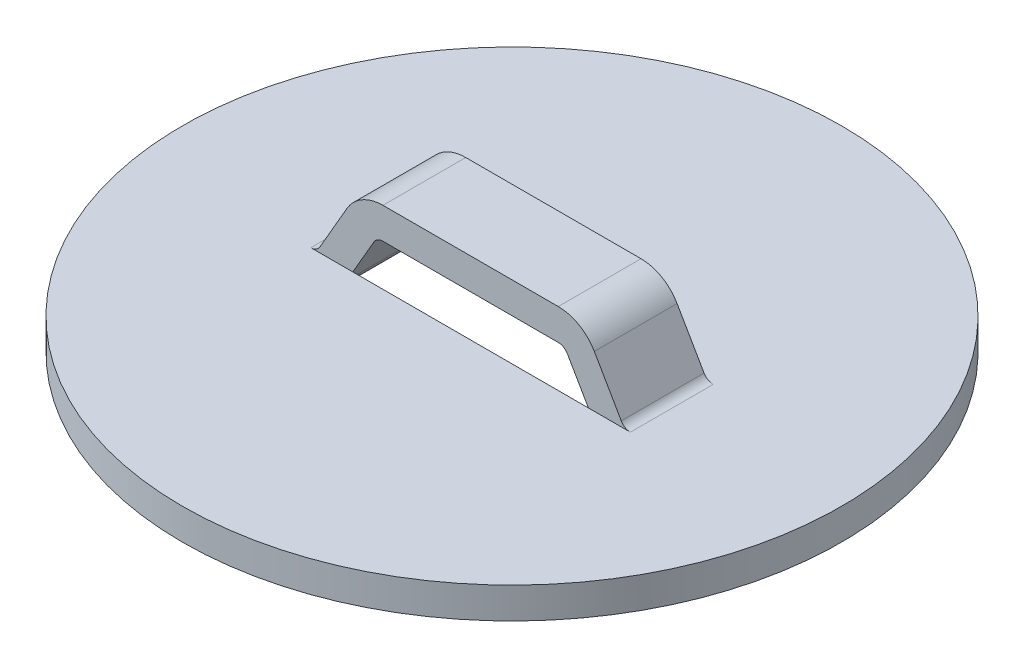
ISO-10303-21;
HEADER;
FILE_DESCRIPTION(('STEP AP214'),'2;1');
FILE_NAME('part.step','',(''),(''),'','','');
FILE_SCHEMA(('AUTOMOTIVE_DESIGN { 1 0 10303 214 1 1 1 1 }'));
ENDSEC;
DATA;
#1=APPLICATION_CONTEXT('core data for automotive mechanical design processes');
#2=APPLICATION_PROTOCOL_DEFINITION('international standard','automotive_design',2000,#1);
#3=PRODUCT_CONTEXT('',#1,'mechanical');
#4=PRODUCT('Part','Part','',(#3));
#5=PRODUCT_RELATED_PRODUCT_CATEGORY('part','',(#4));
#6=PRODUCT_DEFINITION_FORMATION('','',#4);
#7=PRODUCT_DEFINITION_CONTEXT('part definition',#1,'design');
#8=PRODUCT_DEFINITION('design','',#6,#7);
#9=PRODUCT_DEFINITION_SHAPE('','',#8);
#10=(LENGTH_UNIT() NAMED_UNIT(*) SI_UNIT(.MILLI.,.METRE.));
#11=(NAMED_UNIT(*) PLANE_ANGLE_UNIT() SI_UNIT($,.RADIAN.));
#12=(NAMED_UNIT(*) SI_UNIT($,.STERADIAN.) SOLID_ANGLE_UNIT());
#13=UNCERTAINTY_MEASURE_WITH_UNIT(LENGTH_MEASURE(1.E-05),#10,'distance_accuracy_value','');
#14=(GEOMETRIC_REPRESENTATION_CONTEXT(3) GLOBAL_UNCERTAINTY_ASSIGNED_CONTEXT((#13)) GLOBAL_UNIT_ASSIGNED_CONTEXT((#10,
#11,#12)) REPRESENTATION_CONTEXT('',''));
#15=CARTESIAN_POINT('',(0.,0.,0.));
#16=DIRECTION('',(0.,0.,1.));
#17=DIRECTION('',(1.,0.,0.));
#18=AXIS2_PLACEMENT_3D('',#15,#16,#17);
#19=CARTESIAN_POINT('',(-7.69739393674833,0.508,0.));
#20=DIRECTION('',(0.,0.,-1.));
#21=DIRECTION('',(-1.,0.,0.));
#22=AXIS2_PLACEMENT_3D('',#19,#20,#21);
#23=PLANE('',#22);
#24=DIRECTION('',(-1.,0.,0.));
#25=VECTOR('',#24,1.);
#26=CARTESIAN_POINT('',(-7.69739393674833,0.,0.));
#27=LINE('',#26,#25);
#28=CARTESIAN_POINT('',(7.69739393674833,0.,0.));
#29=VERTEX_POINT('',#28);
#30=CARTESIAN_POINT('',(5.67366577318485,0.,0.));
#31=VERTEX_POINT('',#30);
#32=EDGE_CURVE('E53',#29,#31,#27,.T.);
#33=ORIENTED_EDGE('',*,*,#32,.F.);
#34=CARTESIAN_POINT('',(7.69739393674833,0.508,0.));
#35=DIRECTION('',(0.,0.,1.));
#36=DIRECTION('',(1.,0.,0.));
#37=AXIS2_PLACEMENT_3D('',#34,#35,#36);
#38=CIRCLE('',#37,0.508);
#39=CARTESIAN_POINT('',(7.25745303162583,0.254000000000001,0.));
#40=VERTEX_POINT('',#39);
#41=EDGE_CURVE('E165',#29,#40,#38,.F.);
#42=ORIENTED_EDGE('',*,*,#41,.T.);
#43=DIRECTION('',(-0.499999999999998,0.86602540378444,0.));
#44=VECTOR('',#43,1.);
#45=CARTESIAN_POINT('',(5.95962736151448,2.5019,0.));
#46=LINE('',#45,#44);
#47=CARTESIAN_POINT('',(5.95962736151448,2.5019,0.));
#48=VERTEX_POINT('',#47);
#49=EDGE_CURVE('E196',#48,#40,#46,.F.);
#50=ORIENTED_EDGE('',*,*,#49,.F.);
#51=CARTESIAN_POINT('',(4.22186078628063,1.4986,0.));
#52=DIRECTION('',(0.,0.,1.));
#53=DIRECTION('',(1.,0.,0.));
#54=AXIS2_PLACEMENT_3D('',#51,#52,#53);
#55=CIRCLE('',#54,2.0066);
#56=CARTESIAN_POINT('',(4.22186078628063,3.5052,0.));
#57=VERTEX_POINT('',#56);
#58=EDGE_CURVE('E200',#57,#48,#55,.F.);
#59=ORIENTED_EDGE('',*,*,#58,.F.);
#60=DIRECTION('',(1.,0.,0.));
#61=VECTOR('',#60,1.);
#62=CARTESIAN_POINT('',(-4.22186078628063,3.5052,0.));
#63=LINE('',#62,#61);
#64=CARTESIAN_POINT('',(-4.22186078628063,3.5052,0.));
#65=VERTEX_POINT('',#64);
#66=EDGE_CURVE('E204',#65,#57,#63,.T.);
#67=ORIENTED_EDGE('',*,*,#66,.F.);
#68=CARTESIAN_POINT('',(-4.22186078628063,1.4986,0.));
#69=DIRECTION('',(0.,0.,1.));
#70=DIRECTION('',(1.,0.,0.));
#71=AXIS2_PLACEMENT_3D('',#68,#69,#70);
#72=CIRCLE('',#71,2.0066);
#73=CARTESIAN_POINT('',(-5.95962736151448,2.5019,0.));
#74=VERTEX_POINT('',#73);
#75=EDGE_CURVE('E208',#74,#65,#72,.F.);
#76=ORIENTED_EDGE('',*,*,#75,.F.);
#77=DIRECTION('',(-0.499999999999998,-0.86602540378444,0.));
#78=VECTOR('',#77,1.);
#79=CARTESIAN_POINT('',(-7.25745303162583,0.254000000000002,0.));
#80=LINE('',#79,#78);
#81=CARTESIAN_POINT('',(-7.25745303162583,0.254000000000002,0.));
#82=VERTEX_POINT('',#81);
#83=EDGE_CURVE('E212',#82,#74,#80,.F.);
#84=ORIENTED_EDGE('',*,*,#83,.F.);
#85=CARTESIAN_POINT('',(-7.69739393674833,0.508,0.));
#86=DIRECTION('',(0.,0.,1.));
#87=DIRECTION('',(1.,0.,0.));
#88=AXIS2_PLACEMENT_3D('',#85,#86,#87);
#89=CIRCLE('',#88,0.507999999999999);
#90=CARTESIAN_POINT('',(-7.69739393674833,0.,0.));
#91=VERTEX_POINT('',#90);
#92=EDGE_CURVE('E216',#82,#91,#89,.F.);
#93=ORIENTED_EDGE('',*,*,#92,.T.);
#94=CARTESIAN_POINT('',(-5.67366577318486,0.,0.));
#95=VERTEX_POINT('',#94);
#96=EDGE_CURVE('E173',#95,#91,#27,.T.);
#97=ORIENTED_EDGE('',*,*,#96,.F.);
#98=DIRECTION('',(0.499999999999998,0.86602540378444,0.));
#99=VECTOR('',#98,1.);
#100=CARTESIAN_POINT('',(-5.95962736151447,-0.495299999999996,0.));
#101=LINE('',#100,#99);
#102=CARTESIAN_POINT('',(-4.66180169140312,1.7526,0.));
#103=VERTEX_POINT('',#102);
#104=EDGE_CURVE('E218',#103,#95,#101,.F.);
#105=ORIENTED_EDGE('',*,*,#104,.F.);
#106=CARTESIAN_POINT('',(-4.22186078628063,1.4986,0.));
#107=DIRECTION('',(0.,0.,1.));
#108=DIRECTION('',(1.,0.,0.));
#109=AXIS2_PLACEMENT_3D('',#106,#107,#108);
#110=CIRCLE('',#109,0.508);
#111=CARTESIAN_POINT('',(-4.22186078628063,2.0066,0.));
#112=VERTEX_POINT('',#111);
#113=EDGE_CURVE('E222',#103,#112,#110,.F.);
#114=ORIENTED_EDGE('',*,*,#113,.T.);
#115=DIRECTION('',(1.,0.,0.));
#116=VECTOR('',#115,1.);
#117=CARTESIAN_POINT('',(-4.22186078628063,2.0066,0.));
#118=LINE('',#117,#116);
#119=CARTESIAN_POINT('',(4.22186078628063,2.0066,0.));
#120=VERTEX_POINT('',#119);
#121=EDGE_CURVE('E223',#120,#112,#118,.F.);
#122=ORIENTED_EDGE('',*,*,#121,.F.);
#123=CARTESIAN_POINT('',(4.22186078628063,1.4986,0.));
#124=DIRECTION('',(0.,0.,1.));
#125=DIRECTION('',(1.,0.,0.));
#126=AXIS2_PLACEMENT_3D('',#123,#124,#125);
#127=CIRCLE('',#126,0.508);
#128=CARTESIAN_POINT('',(4.66180169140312,1.7526,0.));
#129=VERTEX_POINT('',#128);
#130=EDGE_CURVE('E226',#120,#129,#127,.F.);
#131=ORIENTED_EDGE('',*,*,#130,.T.);
#132=DIRECTION('',(0.499999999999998,-0.86602540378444,0.));
#133=VECTOR('',#132,1.);
#134=CARTESIAN_POINT('',(4.66180169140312,1.7526,0.));
#135=LINE('',#134,#133);
#136=EDGE_CURVE('E168',#31,#129,#135,.F.);
#137=ORIENTED_EDGE('',*,*,#136,.F.);
#138=EDGE_LOOP('',(#33,#42,#50,#59,#67,#76,#84,#93,#97,#105,#114,#122,#131,#137));
#139=FACE_BOUND('',#138,.T.);
#140=ADVANCED_FACE('F39',(#139),#23,.F.);
#141=CARTESIAN_POINT('',(-7.69739393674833,0.508,-3.9878));
#142=DIRECTION('',(0.,0.,-1.));
#143=DIRECTION('',(-1.,0.,0.));
#144=AXIS2_PLACEMENT_3D('',#141,#142,#143);
#145=PLANE('',#144);
#146=CARTESIAN_POINT('',(7.69739393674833,0.508,-3.9878));
#147=DIRECTION('',(0.,0.,1.));
#148=DIRECTION('',(1.,0.,0.));
#149=AXIS2_PLACEMENT_3D('',#146,#147,#148);
#150=CIRCLE('',#149,0.508);
#151=CARTESIAN_POINT('',(7.25745303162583,0.254000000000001,-3.9878));
#152=VERTEX_POINT('',#151);
#153=CARTESIAN_POINT('',(7.69739393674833,0.,-3.9878));
#154=VERTEX_POINT('',#153);
#155=EDGE_CURVE('E250',#152,#154,#150,.T.);
#156=ORIENTED_EDGE('',*,*,#155,.T.);
#157=DIRECTION('',(-1.,0.,0.));
#158=VECTOR('',#157,1.);
#159=CARTESIAN_POINT('',(-7.69739393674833,0.,-3.9878));
#160=LINE('',#159,#158);
#161=CARTESIAN_POINT('',(5.67366577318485,0.,-3.9878));
#162=VERTEX_POINT('',#161);
#163=EDGE_CURVE('E11',#154,#162,#160,.T.);
#164=ORIENTED_EDGE('',*,*,#163,.T.);
#165=DIRECTION('',(-0.499999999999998,0.86602540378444,0.));
#166=VECTOR('',#165,1.);
#167=CARTESIAN_POINT('',(5.95962736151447,-0.495299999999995,-3.9878));
#168=LINE('',#167,#166);
#169=CARTESIAN_POINT('',(4.66180169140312,1.7526,-3.9878));
#170=VERTEX_POINT('',#169);
#171=EDGE_CURVE('E249',#162,#170,#168,.T.);
#172=ORIENTED_EDGE('',*,*,#171,.T.);
#173=CARTESIAN_POINT('',(4.22186078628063,1.4986,-3.9878));
#174=DIRECTION('',(0.,0.,1.));
#175=DIRECTION('',(1.,0.,0.));
#176=AXIS2_PLACEMENT_3D('',#173,#174,#175);
#177=CIRCLE('',#176,0.508);
#178=CARTESIAN_POINT('',(4.22186078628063,2.0066,-3.9878));
#179=VERTEX_POINT('',#178);
#180=EDGE_CURVE('E242',#170,#179,#177,.T.);
#181=ORIENTED_EDGE('',*,*,#180,.T.);
#182=DIRECTION('',(-1.,0.,0.));
#183=VECTOR('',#182,1.);
#184=CARTESIAN_POINT('',(-7.69739393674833,2.0066,-3.9878));
#185=LINE('',#184,#183);
#186=CARTESIAN_POINT('',(-4.22186078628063,2.0066,-3.9878));
#187=VERTEX_POINT('',#186);
#188=EDGE_CURVE('E241',#179,#187,#185,.T.);
#189=ORIENTED_EDGE('',*,*,#188,.T.);
#190=CARTESIAN_POINT('',(-4.22186078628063,1.4986,-3.9878));
#191=DIRECTION('',(0.,0.,1.));
#192=DIRECTION('',(1.,0.,0.));
#193=AXIS2_PLACEMENT_3D('',#190,#191,#192);
#194=CIRCLE('',#193,0.508);
#195=CARTESIAN_POINT('',(-4.66180169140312,1.7526,-3.9878));
#196=VERTEX_POINT('',#195);
#197=EDGE_CURVE('E238',#187,#196,#194,.T.);
#198=ORIENTED_EDGE('',*,*,#197,.T.);
#199=DIRECTION('',(-0.499999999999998,-0.86602540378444,0.));
#200=VECTOR('',#199,1.);
#201=CARTESIAN_POINT('',(-4.66180169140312,1.7526,-3.9878));
#202=LINE('',#201,#200);
#203=CARTESIAN_POINT('',(-5.67366577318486,0.,-3.9878));
#204=VERTEX_POINT('',#203);
#205=EDGE_CURVE('E237',#196,#204,#202,.T.);
#206=ORIENTED_EDGE('',*,*,#205,.T.);
#207=DIRECTION('',(1.,0.,0.));
#208=VECTOR('',#207,1.);
#209=CARTESIAN_POINT('',(-7.69739393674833,0.,-3.9878));
#210=LINE('',#209,#208);
#211=CARTESIAN_POINT('',(-7.69739393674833,0.,-3.9878));
#212=VERTEX_POINT('',#211);
#213=EDGE_CURVE('E285',#212,#204,#210,.T.);
#214=ORIENTED_EDGE('',*,*,#213,.F.);
#215=CARTESIAN_POINT('',(-7.69739393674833,0.508,-3.9878));
#216=DIRECTION('',(0.,0.,1.));
#217=DIRECTION('',(1.,0.,0.));
#218=AXIS2_PLACEMENT_3D('',#215,#216,#217);
#219=CIRCLE('',#218,0.507999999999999);
#220=CARTESIAN_POINT('',(-7.25745303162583,0.254000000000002,-3.9878));
#221=VERTEX_POINT('',#220);
#222=EDGE_CURVE('E261',#212,#221,#219,.T.);
#223=ORIENTED_EDGE('',*,*,#222,.T.);
#224=DIRECTION('',(0.499999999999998,0.86602540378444,0.));
#225=VECTOR('',#224,1.);
#226=CARTESIAN_POINT('',(-7.25745303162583,0.254000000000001,-3.9878));
#227=LINE('',#226,#225);
#228=CARTESIAN_POINT('',(-5.95962736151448,2.5019,-3.9878));
#229=VERTEX_POINT('',#228);
#230=EDGE_CURVE('E260',#221,#229,#227,.T.);
#231=ORIENTED_EDGE('',*,*,#230,.T.);
#232=CARTESIAN_POINT('',(-4.22186078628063,1.4986,-3.9878));
#233=DIRECTION('',(0.,0.,1.));
#234=DIRECTION('',(1.,0.,0.));
#235=AXIS2_PLACEMENT_3D('',#232,#233,#234);
#236=CIRCLE('',#235,2.0066);
#237=CARTESIAN_POINT('',(-4.22186078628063,3.5052,-3.9878));
#238=VERTEX_POINT('',#237);
#239=EDGE_CURVE('E257',#229,#238,#236,.F.);
#240=ORIENTED_EDGE('',*,*,#239,.T.);
#241=DIRECTION('',(-1.,0.,0.));
#242=VECTOR('',#241,1.);
#243=CARTESIAN_POINT('',(-7.69739393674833,3.5052,-3.9878));
#244=LINE('',#243,#242);
#245=CARTESIAN_POINT('',(4.22186078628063,3.5052,-3.9878));
#246=VERTEX_POINT('',#245);
#247=EDGE_CURVE('E256',#238,#246,#244,.F.);
#248=ORIENTED_EDGE('',*,*,#247,.T.);
#249=CARTESIAN_POINT('',(4.22186078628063,1.4986,-3.9878));
#250=DIRECTION('',(0.,0.,1.));
#251=DIRECTION('',(1.,0.,0.));
#252=AXIS2_PLACEMENT_3D('',#249,#250,#251);
#253=CIRCLE('',#252,2.0066);
#254=CARTESIAN_POINT('',(5.95962736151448,2.5019,-3.9878));
#255=VERTEX_POINT('',#254);
#256=EDGE_CURVE('E253',#246,#255,#253,.F.);
#257=ORIENTED_EDGE('',*,*,#256,.T.);
#258=DIRECTION('',(0.499999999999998,-0.86602540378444,0.));
#259=VECTOR('',#258,1.);
#260=CARTESIAN_POINT('',(5.95962736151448,2.5019,-3.9878));
#261=LINE('',#260,#259);
#262=EDGE_CURVE('E252',#255,#152,#261,.T.);
#263=ORIENTED_EDGE('',*,*,#262,.T.);
#264=EDGE_LOOP('',(#156,#164,#172,#181,#189,#198,#206,#214,#223,#231,#240,#248,#257,#263));
#265=FACE_BOUND('',#264,.T.);
#266=ADVANCED_FACE('F355',(#265),#145,.T.);
#267=CARTESIAN_POINT('',(-7.69739393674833,0.508,-3.9878));
#268=DIRECTION('',(0.,0.,1.));
#269=DIRECTION('',(1.,0.,0.));
#270=AXIS2_PLACEMENT_3D('',#267,#268,#269);
#271=CYLINDRICAL_SURFACE('',#270,0.507999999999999);
#272=DIRECTION('',(0.,0.,1.));
#273=VECTOR('',#272,1.);
#274=CARTESIAN_POINT('',(-7.25745303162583,0.254000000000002,-3.9878));
#275=LINE('',#274,#273);
#276=EDGE_CURVE('E209',#221,#82,#275,.T.);
#277=ORIENTED_EDGE('',*,*,#276,.F.);
#278=ORIENTED_EDGE('',*,*,#222,.F.);
#279=DIRECTION('',(0.,0.,1.));
#280=VECTOR('',#279,1.);
#281=CARTESIAN_POINT('',(-7.69739393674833,0.,-3.9878));
#282=LINE('',#281,#280);
#283=EDGE_CURVE('E213',#91,#212,#282,.F.);
#284=ORIENTED_EDGE('',*,*,#283,.F.);
#285=ORIENTED_EDGE('',*,*,#92,.F.);
#286=EDGE_LOOP('',(#277,#278,#284,#285));
#287=FACE_BOUND('',#286,.T.);
#288=ADVANCED_FACE('F283',(#287),#271,.F.);
#289=CARTESIAN_POINT('',(-7.25745303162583,0.254000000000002,-3.9878));
#290=DIRECTION('',(-0.86602540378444,0.499999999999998,0.));
#291=DIRECTION('',(-0.499999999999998,-0.86602540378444,0.));
#292=AXIS2_PLACEMENT_3D('',#289,#290,#291);
#293=PLANE('',#292);
#294=ORIENTED_EDGE('',*,*,#230,.F.);
#295=ORIENTED_EDGE('',*,*,#276,.T.);
#296=ORIENTED_EDGE('',*,*,#83,.T.);
#297=DIRECTION('',(0.,0.,1.));
#298=VECTOR('',#297,1.);
#299=CARTESIAN_POINT('',(-5.95962736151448,2.5019,-3.9878));
#300=LINE('',#299,#298);
#301=EDGE_CURVE('E205',#229,#74,#300,.T.);
#302=ORIENTED_EDGE('',*,*,#301,.F.);
#303=EDGE_LOOP('',(#294,#295,#296,#302));
#304=FACE_BOUND('',#303,.T.);
#305=ADVANCED_FACE('F364',(#304),#293,.T.);
#306=CARTESIAN_POINT('',(-4.22186078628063,1.4986,-3.9878));
#307=DIRECTION('',(0.,0.,1.));
#308=DIRECTION('',(1.,0.,0.));
#309=AXIS2_PLACEMENT_3D('',#306,#307,#308);
#310=CYLINDRICAL_SURFACE('',#309,2.0066);
#311=ORIENTED_EDGE('',*,*,#239,.F.);
#312=ORIENTED_EDGE('',*,*,#301,.T.);
#313=ORIENTED_EDGE('',*,*,#75,.T.);
#314=DIRECTION('',(0.,0.,1.));
#315=VECTOR('',#314,1.);
#316=CARTESIAN_POINT('',(-4.22186078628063,3.5052,-3.9878));
#317=LINE('',#316,#315);
#318=EDGE_CURVE('E201',#238,#65,#317,.T.);
#319=ORIENTED_EDGE('',*,*,#318,.F.);
#320=EDGE_LOOP('',(#311,#312,#313,#319));
#321=FACE_BOUND('',#320,.T.);
#322=ADVANCED_FACE('F407',(#321),#310,.T.);
#323=CARTESIAN_POINT('',(-4.22186078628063,3.5052,-3.9878));
#324=DIRECTION('',(0.,1.,0.));
#325=DIRECTION('',(0.,0.,1.));
#326=AXIS2_PLACEMENT_3D('',#323,#324,#325);
#327=PLANE('',#326);
#328=ORIENTED_EDGE('',*,*,#247,.F.);
#329=ORIENTED_EDGE('',*,*,#318,.T.);
#330=ORIENTED_EDGE('',*,*,#66,.T.);
#331=DIRECTION('',(0.,0.,1.));
#332=VECTOR('',#331,1.);
#333=CARTESIAN_POINT('',(4.22186078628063,3.5052,-3.9878));
#334=LINE('',#333,#332);
#335=EDGE_CURVE('E197',#246,#57,#334,.T.);
#336=ORIENTED_EDGE('',*,*,#335,.F.);
#337=EDGE_LOOP('',(#328,#329,#330,#336));
#338=FACE_BOUND('',#337,.T.);
#339=ADVANCED_FACE('F403',(#338),#327,.T.);
#340=CARTESIAN_POINT('',(4.22186078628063,1.4986,-3.9878));
#341=DIRECTION('',(0.,0.,1.));
#342=DIRECTION('',(1.,0.,0.));
#343=AXIS2_PLACEMENT_3D('',#340,#341,#342);
#344=CYLINDRICAL_SURFACE('',#343,2.0066);
#345=ORIENTED_EDGE('',*,*,#256,.F.);
#346=ORIENTED_EDGE('',*,*,#335,.T.);
#347=ORIENTED_EDGE('',*,*,#58,.T.);
#348=DIRECTION('',(0.,0.,1.));
#349=VECTOR('',#348,1.);
#350=CARTESIAN_POINT('',(5.95962736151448,2.5019,-3.9878));
#351=LINE('',#350,#349);
#352=EDGE_CURVE('E193',#255,#48,#351,.T.);
#353=ORIENTED_EDGE('',*,*,#352,.F.);
#354=EDGE_LOOP('',(#345,#346,#347,#353));
#355=FACE_BOUND('',#354,.T.);
#356=ADVANCED_FACE('F399',(#355),#344,.T.);
#357=CARTESIAN_POINT('',(5.95962736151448,2.5019,-3.9878));
#358=DIRECTION('',(0.86602540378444,0.499999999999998,0.));
#359=DIRECTION('',(-0.499999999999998,0.86602540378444,0.));
#360=AXIS2_PLACEMENT_3D('',#357,#358,#359);
#361=PLANE('',#360);
#362=ORIENTED_EDGE('',*,*,#262,.F.);
#363=ORIENTED_EDGE('',*,*,#352,.T.);
#364=ORIENTED_EDGE('',*,*,#49,.T.);
#365=DIRECTION('',(0.,0.,1.));
#366=VECTOR('',#365,1.);
#367=CARTESIAN_POINT('',(7.25745303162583,0.254000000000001,-3.9878));
#368=LINE('',#367,#366);
#369=EDGE_CURVE('E179',#40,#152,#368,.F.);
#370=ORIENTED_EDGE('',*,*,#369,.T.);
#371=EDGE_LOOP('',(#362,#363,#364,#370));
#372=FACE_BOUND('',#371,.T.);
#373=ADVANCED_FACE('F396',(#372),#361,.T.);
#374=CARTESIAN_POINT('',(7.69739393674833,0.508,-3.9878));
#375=DIRECTION('',(0.,0.,1.));
#376=DIRECTION('',(1.,0.,0.));
#377=AXIS2_PLACEMENT_3D('',#374,#375,#376);
#378=CYLINDRICAL_SURFACE('',#377,0.508);
#379=DIRECTION('',(0.,0.,1.));
#380=VECTOR('',#379,1.);
#381=CARTESIAN_POINT('',(7.69739393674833,0.,-3.9878));
#382=LINE('',#381,#380);
#383=EDGE_CURVE('E177',#154,#29,#382,.T.);
#384=ORIENTED_EDGE('',*,*,#383,.F.);
#385=ORIENTED_EDGE('',*,*,#155,.F.);
#386=ORIENTED_EDGE('',*,*,#369,.F.);
#387=ORIENTED_EDGE('',*,*,#41,.F.);
#388=EDGE_LOOP('',(#384,#385,#386,#387));
#389=FACE_BOUND('',#388,.T.);
#390=ADVANCED_FACE('F175',(#389),#378,.F.);
#391=CARTESIAN_POINT('',(7.69739393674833,0.,-3.9878));
#392=DIRECTION('',(0.,1.,0.));
#393=DIRECTION('',(0.,0.,1.));
#394=AXIS2_PLACEMENT_3D('',#391,#392,#393);
#395=PLANE('',#394);
#396=CARTESIAN_POINT('',(0.,0.,-1.9939));
#397=DIRECTION('',(0.,-1.,0.));
#398=DIRECTION('',(0.,0.,-1.));
#399=AXIS2_PLACEMENT_3D('',#396,#397,#398);
#400=CIRCLE('',#399,15.875);
#401=CARTESIAN_POINT('',(0.,0.,-17.8689));
#402=VERTEX_POINT('',#401);
#403=EDGE_CURVE('E294',#402,#402,#400,.T.);
#404=ORIENTED_EDGE('',*,*,#403,.F.);
#405=EDGE_LOOP('',(#404));
#406=FACE_BOUND('',#405,.T.);
#407=ORIENTED_EDGE('',*,*,#383,.T.);
#408=ORIENTED_EDGE('',*,*,#32,.T.);
#409=EDGE_CURVE('E171',#31,#95,#27,.T.);
#410=ORIENTED_EDGE('',*,*,#409,.T.);
#411=ORIENTED_EDGE('',*,*,#96,.T.);
#412=ORIENTED_EDGE('',*,*,#283,.T.);
#413=ORIENTED_EDGE('',*,*,#213,.T.);
#414=EDGE_CURVE('E170',#204,#162,#210,.T.);
#415=ORIENTED_EDGE('',*,*,#414,.T.);
#416=ORIENTED_EDGE('',*,*,#163,.F.);
#417=EDGE_LOOP('',(#407,#408,#410,#411,#412,#413,#415,#416));
#418=FACE_BOUND('',#417,.T.);
#419=ADVANCED_FACE('F182',(#406,#418),#395,.T.);
#420=CARTESIAN_POINT('',(7.69739393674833,0.508,-3.9878));
#421=DIRECTION('',(0.,0.,1.));
#422=DIRECTION('',(1.,0.,0.));
#423=AXIS2_PLACEMENT_3D('',#420,#421,#422);
#424=CYLINDRICAL_SURFACE('',#423,2.0066);
#425=CARTESIAN_POINT('',(7.69739393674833,0.508,-3.9878));
#426=DIRECTION('',(0.,0.,1.));
#427=DIRECTION('',(1.,0.,0.));
#428=AXIS2_PLACEMENT_3D('',#425,#426,#427);
#429=CIRCLE('',#428,2.0066);
#430=CARTESIAN_POINT('',(7.69739393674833,-1.4986,-3.9878));
#431=VERTEX_POINT('',#430);
#432=CARTESIAN_POINT('',(5.95962736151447,-0.495299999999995,-3.9878));
#433=VERTEX_POINT('',#432);
#434=EDGE_CURVE('E246',#431,#433,#429,.F.);
#435=ORIENTED_EDGE('',*,*,#434,.F.);
#436=DIRECTION('',(0.,0.,1.));
#437=VECTOR('',#436,1.);
#438=CARTESIAN_POINT('',(7.69739393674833,-1.4986,-3.9878));
#439=LINE('',#438,#437);
#440=CARTESIAN_POINT('',(7.69739393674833,-1.4986,0.));
#441=VERTEX_POINT('',#440);
#442=EDGE_CURVE('E187',#431,#441,#439,.T.);
#443=ORIENTED_EDGE('',*,*,#442,.T.);
#444=CARTESIAN_POINT('',(7.69739393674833,0.508,0.));
#445=DIRECTION('',(0.,0.,1.));
#446=DIRECTION('',(1.,0.,0.));
#447=AXIS2_PLACEMENT_3D('',#444,#445,#446);
#448=CIRCLE('',#447,2.0066);
#449=CARTESIAN_POINT('',(5.95962736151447,-0.495299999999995,0.));
#450=VERTEX_POINT('',#449);
#451=EDGE_CURVE('E184',#441,#450,#448,.F.);
#452=ORIENTED_EDGE('',*,*,#451,.T.);
#453=DIRECTION('',(0.,0.,1.));
#454=VECTOR('',#453,1.);
#455=CARTESIAN_POINT('',(5.95962736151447,-0.495299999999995,-3.9878));
#456=LINE('',#455,#454);
#457=EDGE_CURVE('E229',#433,#450,#456,.T.);
#458=ORIENTED_EDGE('',*,*,#457,.F.);
#459=EDGE_LOOP('',(#435,#443,#452,#458));
#460=FACE_BOUND('',#459,.T.);
#461=ADVANCED_FACE('F328',(#460),#424,.T.);
#462=CARTESIAN_POINT('',(4.66180169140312,1.7526,-3.9878));
#463=DIRECTION('',(-0.86602540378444,-0.499999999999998,0.));
#464=DIRECTION('',(0.499999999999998,-0.86602540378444,0.));
#465=AXIS2_PLACEMENT_3D('',#462,#463,#464);
#466=PLANE('',#465);
#467=EDGE_CURVE('E245',#433,#162,#168,.T.);
#468=ORIENTED_EDGE('',*,*,#467,.F.);
#469=ORIENTED_EDGE('',*,*,#457,.T.);
#470=EDGE_CURVE('E227',#450,#31,#135,.F.);
#471=ORIENTED_EDGE('',*,*,#470,.T.);
#472=ORIENTED_EDGE('',*,*,#136,.T.);
#473=DIRECTION('',(0.,0.,1.));
#474=VECTOR('',#473,1.);
#475=CARTESIAN_POINT('',(4.66180169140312,1.7526,-3.9878));
#476=LINE('',#475,#474);
#477=EDGE_CURVE('E272',#129,#170,#476,.F.);
#478=ORIENTED_EDGE('',*,*,#477,.T.);
#479=ORIENTED_EDGE('',*,*,#171,.F.);
#480=EDGE_LOOP('',(#468,#469,#471,#472,#478,#479));
#481=FACE_BOUND('',#480,.T.);
#482=ADVANCED_FACE('F325',(#481),#466,.T.);
#483=CARTESIAN_POINT('',(4.22186078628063,1.4986,-3.9878));
#484=DIRECTION('',(0.,0.,1.));
#485=DIRECTION('',(1.,0.,0.));
#486=AXIS2_PLACEMENT_3D('',#483,#484,#485);
#487=CYLINDRICAL_SURFACE('',#486,0.508);
#488=DIRECTION('',(0.,0.,-1.));
#489=VECTOR('',#488,1.);
#490=CARTESIAN_POINT('',(4.22186078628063,2.0066,-3.9878));
#491=LINE('',#490,#489);
#492=EDGE_CURVE('E225',#179,#120,#491,.F.);
#493=ORIENTED_EDGE('',*,*,#492,.F.);
#494=ORIENTED_EDGE('',*,*,#180,.F.);
#495=ORIENTED_EDGE('',*,*,#477,.F.);
#496=ORIENTED_EDGE('',*,*,#130,.F.);
#497=EDGE_LOOP('',(#493,#494,#495,#496));
#498=FACE_BOUND('',#497,.T.);
#499=ADVANCED_FACE('F382',(#498),#487,.F.);
#500=CARTESIAN_POINT('',(-4.22186078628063,2.0066,-3.9878));
#501=DIRECTION('',(0.,-1.,0.));
#502=DIRECTION('',(0.,0.,-1.));
#503=AXIS2_PLACEMENT_3D('',#500,#501,#502);
#504=PLANE('',#503);
#505=ORIENTED_EDGE('',*,*,#188,.F.);
#506=ORIENTED_EDGE('',*,*,#492,.T.);
#507=ORIENTED_EDGE('',*,*,#121,.T.);
#508=DIRECTION('',(0.,0.,1.));
#509=VECTOR('',#508,1.);
#510=CARTESIAN_POINT('',(-4.22186078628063,2.0066,-3.9878));
#511=LINE('',#510,#509);
#512=EDGE_CURVE('E271',#112,#187,#511,.F.);
#513=ORIENTED_EDGE('',*,*,#512,.T.);
#514=EDGE_LOOP('',(#505,#506,#507,#513));
#515=FACE_BOUND('',#514,.T.);
#516=ADVANCED_FACE('F378',(#515),#504,.T.);
#517=CARTESIAN_POINT('',(-4.22186078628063,1.4986,-3.9878));
#518=DIRECTION('',(0.,0.,1.));
#519=DIRECTION('',(1.,0.,0.));
#520=AXIS2_PLACEMENT_3D('',#517,#518,#519);
#521=CYLINDRICAL_SURFACE('',#520,0.508);
#522=DIRECTION('',(0.,0.,1.));
#523=VECTOR('',#522,1.);
#524=CARTESIAN_POINT('',(-4.66180169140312,1.7526,-3.9878));
#525=LINE('',#524,#523);
#526=EDGE_CURVE('E221',#196,#103,#525,.T.);
#527=ORIENTED_EDGE('',*,*,#526,.F.);
#528=ORIENTED_EDGE('',*,*,#197,.F.);
#529=ORIENTED_EDGE('',*,*,#512,.F.);
#530=ORIENTED_EDGE('',*,*,#113,.F.);
#531=EDGE_LOOP('',(#527,#528,#529,#530));
#532=FACE_BOUND('',#531,.T.);
#533=ADVANCED_FACE('F375',(#532),#521,.F.);
#534=CARTESIAN_POINT('',(-5.95962736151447,-0.495299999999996,-3.9878));
#535=DIRECTION('',(0.86602540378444,-0.499999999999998,0.));
#536=DIRECTION('',(0.499999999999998,0.86602540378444,0.));
#537=AXIS2_PLACEMENT_3D('',#534,#535,#536);
#538=PLANE('',#537);
#539=ORIENTED_EDGE('',*,*,#205,.F.);
#540=ORIENTED_EDGE('',*,*,#526,.T.);
#541=ORIENTED_EDGE('',*,*,#104,.T.);
#542=DIRECTION('',(-0.499999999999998,-0.86602540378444,0.));
#543=VECTOR('',#542,1.);
#544=CARTESIAN_POINT('',(-5.95962736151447,-0.495299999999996,0.));
#545=LINE('',#544,#543);
#546=CARTESIAN_POINT('',(-5.95962736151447,-0.495299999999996,0.));
#547=VERTEX_POINT('',#546);
#548=EDGE_CURVE('E217',#95,#547,#545,.T.);
#549=ORIENTED_EDGE('',*,*,#548,.T.);
#550=DIRECTION('',(0.,0.,1.));
#551=VECTOR('',#550,1.);
#552=CARTESIAN_POINT('',(-5.95962736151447,-0.495299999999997,-3.9878));
#553=LINE('',#552,#551);
#554=CARTESIAN_POINT('',(-5.95962736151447,-0.495299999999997,-3.9878));
#555=VERTEX_POINT('',#554);
#556=EDGE_CURVE('E268',#555,#547,#553,.T.);
#557=ORIENTED_EDGE('',*,*,#556,.F.);
#558=EDGE_CURVE('E61',#204,#555,#202,.T.);
#559=ORIENTED_EDGE('',*,*,#558,.F.);
#560=EDGE_LOOP('',(#539,#540,#541,#549,#557,#559));
#561=FACE_BOUND('',#560,.T.);
#562=ADVANCED_FACE('F370',(#561),#538,.T.);
#563=CARTESIAN_POINT('',(-7.69739393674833,0.508,-3.9878));
#564=DIRECTION('',(0.,0.,1.));
#565=DIRECTION('',(1.,0.,0.));
#566=AXIS2_PLACEMENT_3D('',#563,#564,#565);
#567=CYLINDRICAL_SURFACE('',#566,2.0066);
#568=CARTESIAN_POINT('',(-7.69739393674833,0.508,-3.9878));
#569=DIRECTION('',(0.,0.,1.));
#570=DIRECTION('',(1.,0.,0.));
#571=AXIS2_PLACEMENT_3D('',#568,#569,#570);
#572=CIRCLE('',#571,2.0066);
#573=CARTESIAN_POINT('',(-7.69739393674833,-1.4986,-3.9878));
#574=VERTEX_POINT('',#573);
#575=EDGE_CURVE('E46',#555,#574,#572,.F.);
#576=ORIENTED_EDGE('',*,*,#575,.F.);
#577=ORIENTED_EDGE('',*,*,#556,.T.);
#578=CARTESIAN_POINT('',(-7.69739393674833,0.508,0.));
#579=DIRECTION('',(0.,0.,1.));
#580=DIRECTION('',(1.,0.,0.));
#581=AXIS2_PLACEMENT_3D('',#578,#579,#580);
#582=CIRCLE('',#581,2.0066);
#583=CARTESIAN_POINT('',(-7.69739393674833,-1.4986,0.));
#584=VERTEX_POINT('',#583);
#585=EDGE_CURVE('E265',#547,#584,#582,.F.);
#586=ORIENTED_EDGE('',*,*,#585,.T.);
#587=DIRECTION('',(0.,0.,-1.));
#588=VECTOR('',#587,1.);
#589=CARTESIAN_POINT('',(-7.69739393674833,-1.4986,-3.9878));
#590=LINE('',#589,#588);
#591=EDGE_CURVE('E264',#574,#584,#590,.F.);
#592=ORIENTED_EDGE('',*,*,#591,.F.);
#593=EDGE_LOOP('',(#576,#577,#586,#592));
#594=FACE_BOUND('',#593,.T.);
#595=ADVANCED_FACE('F340',(#594),#567,.T.);
#596=CARTESIAN_POINT('',(-15.875,-1.4986,-3.9878));
#597=DIRECTION('',(0.,-1.,0.));
#598=DIRECTION('',(0.,0.,-1.));
#599=AXIS2_PLACEMENT_3D('',#596,#597,#598);
#600=PLANE('',#599);
#601=DIRECTION('',(-1.,0.,0.));
#602=VECTOR('',#601,1.);
#603=CARTESIAN_POINT('',(-7.69739393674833,-1.4986,0.));
#604=LINE('',#603,#602);
#605=EDGE_CURVE('E288',#441,#584,#604,.T.);
#606=ORIENTED_EDGE('',*,*,#605,.F.);
#607=ORIENTED_EDGE('',*,*,#442,.F.);
#608=DIRECTION('',(1.,0.,0.));
#609=VECTOR('',#608,1.);
#610=CARTESIAN_POINT('',(-7.69739393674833,-1.4986,-3.9878));
#611=LINE('',#610,#609);
#612=EDGE_CURVE('E286',#574,#431,#611,.T.);
#613=ORIENTED_EDGE('',*,*,#612,.F.);
#614=ORIENTED_EDGE('',*,*,#591,.T.);
#615=EDGE_LOOP('',(#606,#607,#613,#614));
#616=FACE_BOUND('',#615,.T.);
#617=CARTESIAN_POINT('',(0.,-1.4986,-1.9939));
#618=DIRECTION('',(0.,-1.,0.));
#619=DIRECTION('',(0.,0.,-1.));
#620=AXIS2_PLACEMENT_3D('',#617,#618,#619);
#621=CIRCLE('',#620,15.875);
#622=CARTESIAN_POINT('',(0.,-1.4986,-17.8689));
#623=VERTEX_POINT('',#622);
#624=EDGE_CURVE('E292',#623,#623,#621,.T.);
#625=ORIENTED_EDGE('',*,*,#624,.T.);
#626=EDGE_LOOP('',(#625));
#627=FACE_BOUND('',#626,.T.);
#628=ADVANCED_FACE('F335',(#616,#627),#600,.T.);
#629=CARTESIAN_POINT('',(0.,0.,-1.9939));
#630=DIRECTION('',(0.,-1.,0.));
#631=DIRECTION('',(0.,0.,-1.));
#632=AXIS2_PLACEMENT_3D('',#629,#630,#631);
#633=CYLINDRICAL_SURFACE('',#632,15.875);
#634=CARTESIAN_POINT('',(0.,0.,-17.8689));
#635=CARTESIAN_POINT('',(0.,-0.0156104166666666,-17.8689));
#636=CARTESIAN_POINT('',(0.,-0.0312208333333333,-17.8689));
#637=CARTESIAN_POINT('',(0.,-0.0624416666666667,-17.8689));
#638=CARTESIAN_POINT('',(0.,-0.0780520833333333,-17.8689));
#639=CARTESIAN_POINT('',(0.,-0.109272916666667,-17.8689));
#640=CARTESIAN_POINT('',(0.,-0.124883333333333,-17.8689));
#641=CARTESIAN_POINT('',(0.,-0.156104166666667,-17.8689));
#642=CARTESIAN_POINT('',(0.,-0.171714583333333,-17.8689));
#643=CARTESIAN_POINT('',(0.,-0.202935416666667,-17.8689));
#644=CARTESIAN_POINT('',(0.,-0.218545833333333,-17.8689));
#645=CARTESIAN_POINT('',(0.,-0.249766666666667,-17.8689));
#646=CARTESIAN_POINT('',(0.,-0.265377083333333,-17.8689));
#647=CARTESIAN_POINT('',(0.,-0.296597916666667,-17.8689));
#648=CARTESIAN_POINT('',(0.,-0.312208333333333,-17.8689));
#649=CARTESIAN_POINT('',(0.,-0.343429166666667,-17.8689));
#650=CARTESIAN_POINT('',(0.,-0.359039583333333,-17.8689));
#651=CARTESIAN_POINT('',(0.,-0.390260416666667,-17.8689));
#652=CARTESIAN_POINT('',(0.,-0.405870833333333,-17.8689));
#653=CARTESIAN_POINT('',(0.,-0.437091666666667,-17.8689));
#654=CARTESIAN_POINT('',(0.,-0.452702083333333,-17.8689));
#655=CARTESIAN_POINT('',(0.,-0.483922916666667,-17.8689));
#656=CARTESIAN_POINT('',(0.,-0.499533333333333,-17.8689));
#657=CARTESIAN_POINT('',(0.,-0.530754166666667,-17.8689));
#658=CARTESIAN_POINT('',(0.,-0.546364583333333,-17.8689));
#659=CARTESIAN_POINT('',(0.,-0.577585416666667,-17.8689));
#660=CARTESIAN_POINT('',(0.,-0.593195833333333,-17.8689));
#661=CARTESIAN_POINT('',(0.,-0.624416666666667,-17.8689));
#662=CARTESIAN_POINT('',(0.,-0.640027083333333,-17.8689));
#663=CARTESIAN_POINT('',(0.,-0.671247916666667,-17.8689));
#664=CARTESIAN_POINT('',(0.,-0.686858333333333,-17.8689));
#665=CARTESIAN_POINT('',(0.,-0.718079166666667,-17.8689));
#666=CARTESIAN_POINT('',(0.,-0.733689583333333,-17.8689));
#667=CARTESIAN_POINT('',(0.,-0.764910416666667,-17.8689));
#668=CARTESIAN_POINT('',(0.,-0.780520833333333,-17.8689));
#669=CARTESIAN_POINT('',(0.,-0.811741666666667,-17.8689));
#670=CARTESIAN_POINT('',(0.,-0.827352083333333,-17.8689));
#671=CARTESIAN_POINT('',(0.,-0.858572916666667,-17.8689));
#672=CARTESIAN_POINT('',(0.,-0.874183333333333,-17.8689));
#673=CARTESIAN_POINT('',(0.,-0.905404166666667,-17.8689));
#674=CARTESIAN_POINT('',(0.,-0.921014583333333,-17.8689));
#675=CARTESIAN_POINT('',(0.,-0.952235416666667,-17.8689));
#676=CARTESIAN_POINT('',(0.,-0.967845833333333,-17.8689));
#677=CARTESIAN_POINT('',(0.,-0.999066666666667,-17.8689));
#678=CARTESIAN_POINT('',(0.,-1.01467708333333,-17.8689));
#679=CARTESIAN_POINT('',(0.,-1.04589791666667,-17.8689));
#680=CARTESIAN_POINT('',(0.,-1.06150833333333,-17.8689));
#681=CARTESIAN_POINT('',(0.,-1.09272916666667,-17.8689));
#682=CARTESIAN_POINT('',(0.,-1.10833958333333,-17.8689));
#683=CARTESIAN_POINT('',(0.,-1.13956041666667,-17.8689));
#684=CARTESIAN_POINT('',(0.,-1.15517083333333,-17.8689));
#685=CARTESIAN_POINT('',(0.,-1.18639166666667,-17.8689));
#686=CARTESIAN_POINT('',(0.,-1.20200208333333,-17.8689));
#687=CARTESIAN_POINT('',(0.,-1.23322291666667,-17.8689));
#688=CARTESIAN_POINT('',(0.,-1.24883333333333,-17.8689));
#689=CARTESIAN_POINT('',(0.,-1.28005416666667,-17.8689));
#690=CARTESIAN_POINT('',(0.,-1.29566458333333,-17.8689));
#691=CARTESIAN_POINT('',(0.,-1.32688541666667,-17.8689));
#692=CARTESIAN_POINT('',(0.,-1.34249583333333,-17.8689));
#693=CARTESIAN_POINT('',(0.,-1.37371666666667,-17.8689));
#694=CARTESIAN_POINT('',(0.,-1.38932708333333,-17.8689));
#695=CARTESIAN_POINT('',(0.,-1.42054791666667,-17.8689));
#696=CARTESIAN_POINT('',(0.,-1.43615833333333,-17.8689));
#697=CARTESIAN_POINT('',(0.,-1.46737916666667,-17.8689));
#698=CARTESIAN_POINT('',(0.,-1.48298958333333,-17.8689));
#699=CARTESIAN_POINT('',(0.,-1.4986,-17.8689));
#700=B_SPLINE_CURVE_WITH_KNOTS('',3,(#634,#635,#636,#637,#638,#639,#640,#641,#642,#643,#644,
#645,#646,#647,#648,#649,#650,#651,#652,#653,#654,#655,#656,#657,#658,#659,#660,#661,#662,#663,
#664,#665,#666,#667,#668,#669,#670,#671,#672,#673,#674,#675,#676,#677,#678,#679,#680,#681,#682,
#683,#684,#685,#686,#687,#688,#689,#690,#691,#692,#693,#694,#695,#696,#697,#698,#699),
.UNSPECIFIED.,.F.,.F.,(4,2,2,2,2,2,2,2,2,2,2,2,2,2,2,2,2,2,2,2,2,2,2,2,2,2,2,2,2,2,2,2,4),(0.,
0.04683125,0.0936625,0.14049375,0.187325,0.23415625,0.2809875,0.32781875,0.37465,0.42148125,
0.4683125,0.51514375,0.561975,0.60880625,0.6556375,0.70246875,0.7493,0.79613125,0.8429625,
0.88979375,0.936625,0.98345625,1.0302875,1.07711875,1.12395,1.17078125,1.2176125,1.26444375,
1.311275,1.35810625,1.4049375,1.45176875,1.4986),.UNSPECIFIED.);
#701=EDGE_CURVE('BSEAM345',#402,#623,#700,.T.);
#702=ORIENTED_EDGE('',*,*,#403,.T.);
#703=ORIENTED_EDGE('',*,*,#624,.F.);
#704=ORIENTED_EDGE('',*,*,#701,.T.);
#705=ORIENTED_EDGE('',*,*,#701,.F.);
#706=EDGE_LOOP('',(#702,#704,#703,#705));
#707=FACE_BOUND('',#706,.T.);
#708=ADVANCED_FACE('F345',(#707),#633,.T.);
#709=CARTESIAN_POINT('',(-7.69739393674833,0.,-3.9878));
#710=DIRECTION('',(0.,0.,-1.));
#711=DIRECTION('',(-1.,0.,0.));
#712=AXIS2_PLACEMENT_3D('',#709,#710,#711);
#713=PLANE('',#712);
#714=ORIENTED_EDGE('',*,*,#434,.T.);
#715=ORIENTED_EDGE('',*,*,#467,.T.);
#716=ORIENTED_EDGE('',*,*,#414,.F.);
#717=ORIENTED_EDGE('',*,*,#558,.T.);
#718=ORIENTED_EDGE('',*,*,#575,.T.);
#719=ORIENTED_EDGE('',*,*,#612,.T.);
#720=EDGE_LOOP('',(#714,#715,#716,#717,#718,#719));
#721=FACE_BOUND('',#720,.T.);
#722=ADVANCED_FACE('F342',(#721),#713,.F.);
#723=CARTESIAN_POINT('',(-7.69739393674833,0.,0.));
#724=DIRECTION('',(0.,0.,1.));
#725=DIRECTION('',(1.,0.,0.));
#726=AXIS2_PLACEMENT_3D('',#723,#724,#725);
#727=PLANE('',#726);
#728=ORIENTED_EDGE('',*,*,#451,.F.);
#729=ORIENTED_EDGE('',*,*,#605,.T.);
#730=ORIENTED_EDGE('',*,*,#585,.F.);
#731=ORIENTED_EDGE('',*,*,#548,.F.);
#732=ORIENTED_EDGE('',*,*,#409,.F.);
#733=ORIENTED_EDGE('',*,*,#470,.F.);
#734=EDGE_LOOP('',(#728,#729,#730,#731,#732,#733));
#735=FACE_BOUND('',#734,.T.);
#736=ADVANCED_FACE('F333',(#735),#727,.F.);
#737=CLOSED_SHELL('',(#140,#266,#288,#305,#322,#339,#356,#373,#390,#419,#461,#482,#499,#516,
#533,#562,#595,#628,#708,#722,#736));
#738=MANIFOLD_SOLID_BREP('B2',#737);
#739=ADVANCED_BREP_SHAPE_REPRESENTATION('',(#18,#738),#14);
#740=SHAPE_DEFINITION_REPRESENTATION(#9,#739);
ENDSEC;
END-ISO-10303-21;
